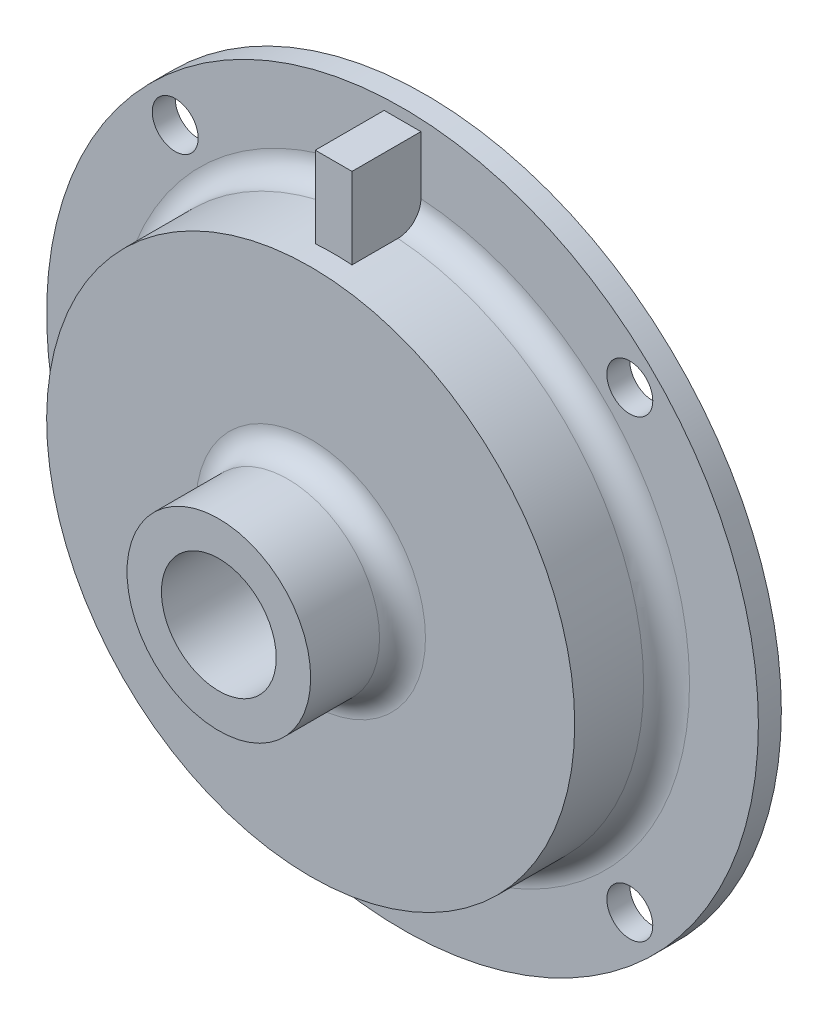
from build123d import *

# Parameters (mm, degrees)
SKETCH1_R           = 49.2125
BASE_EXTRUDE_DEPTH  = 3.175
SKETCH5_R           = 3.175
CUT_EXTRUDE2_DEPTH  = 70.669368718
CIRPATTERN1_COUNT   = 4
SKETCH2_R           = 36.5125
BOSS_EXTRUDE1_DEPTH = 12.7
SKETCH3_R           = 12.7
BOSS_EXTRUDE2_DEPTH = 12.7
FILLET1_R           = 3.175
SKETCH6_W           = 5.08
SKETCH6_H           = 9.525
BOSS_EXTRUDE3_DEPTH = 47.625
SKETCH4_R           = 7.9375
CUT_EXTRUDE1_DEPTH  = 76.23477213


with BuildPart() as part:
    # Sketch1 → Base-Extrude (new body)
    with BuildSketch(Plane.XY):
        Circle(SKETCH1_R)
    extrude(amount=BASE_EXTRUDE_DEPTH)

    # Sketch5 → Cut-Extrude2 (cut, through all)
    with BuildSketch(Plane.XY.offset(3.175)):
        with Locations((31.430896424, 31.430896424)):
            Circle(SKETCH5_R)
    cut_extrude2 = extrude(amount=-CUT_EXTRUDE2_DEPTH, mode=Mode.SUBTRACT)

    # CirPattern1: Cut-Extrude2 ×4 about axis
    cirpattern1_axis = Axis((0, 0, 0), (0, 0, 1))
    for i in range(1, CIRPATTERN1_COUNT):
        add(cut_extrude2.rotate(cirpattern1_axis, i * 360 / CIRPATTERN1_COUNT), mode=Mode.SUBTRACT)

    # Sketch2 → Boss-Extrude1 (add)
    with BuildSketch(Plane.XY.offset(3.175)):
        Circle(SKETCH2_R)
    extrude(amount=BOSS_EXTRUDE1_DEPTH)

    # Sketch3 → Boss-Extrude2 (add)
    with BuildSketch(Plane.XY.offset(15.875)):
        Circle(SKETCH3_R)
    extrude(amount=BOSS_EXTRUDE2_DEPTH)

    # Fillet1
    fillet1_edges = [part.edges().sort_by_distance(p)[0] for p in [
        (-36.5125, 0, 3.175),
        (-12.7, 0, 15.875),
    ]]
    fillet(fillet1_edges, radius=FILLET1_R)

    # Sketch6 → Boss-Extrude3 (add)
    with BuildSketch(Plane(origin=(0, 0, 0), x_dir=(1, 0, 0), z_dir=(0, 1, 0))):
        with Locations((0, -7.9375)):
            Rectangle(SKETCH6_W, SKETCH6_H)
    extrude(amount=BOSS_EXTRUDE3_DEPTH)

    # Sketch4 → Cut-Extrude1 (cut, through all)
    with BuildSketch(Plane.XY.offset(28.575)):
        Circle(SKETCH4_R)
    extrude(amount=-CUT_EXTRUDE1_DEPTH, mode=Mode.SUBTRACT)


solid = part.part
